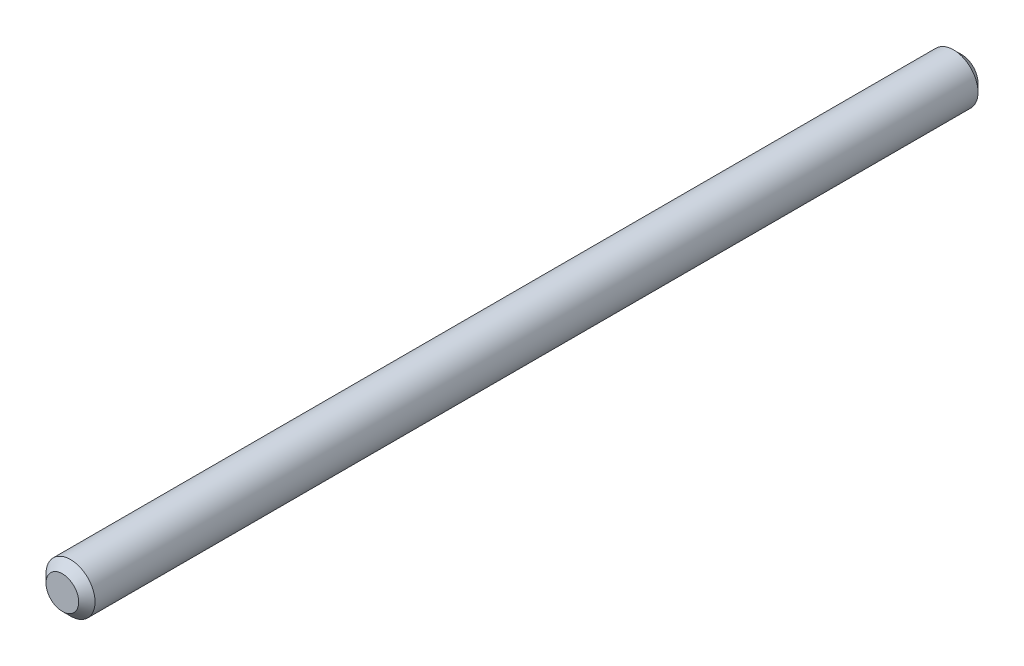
from build123d import *

# Parameters (mm, degrees)
ESQUISSE1_R          = 1.5
BASE_EXTRUSION_DEPTH = 55
CHANFREIN1_SIZE      = 0.5


with BuildPart() as part:
    # Esquisse1 → Base-Extrusion (new body)
    with BuildSketch(Plane.XY):
        Circle(ESQUISSE1_R)
    extrude(amount=BASE_EXTRUSION_DEPTH)

    # Chanfrein1
    chanfrein1_edges = [part.edges().sort_by_distance(p)[0] for p in [
        (-1.5, 0, 0),
        (-1.5, 0, 55),
    ]]
    chamfer(chanfrein1_edges, length=CHANFREIN1_SIZE)


solid = part.part
